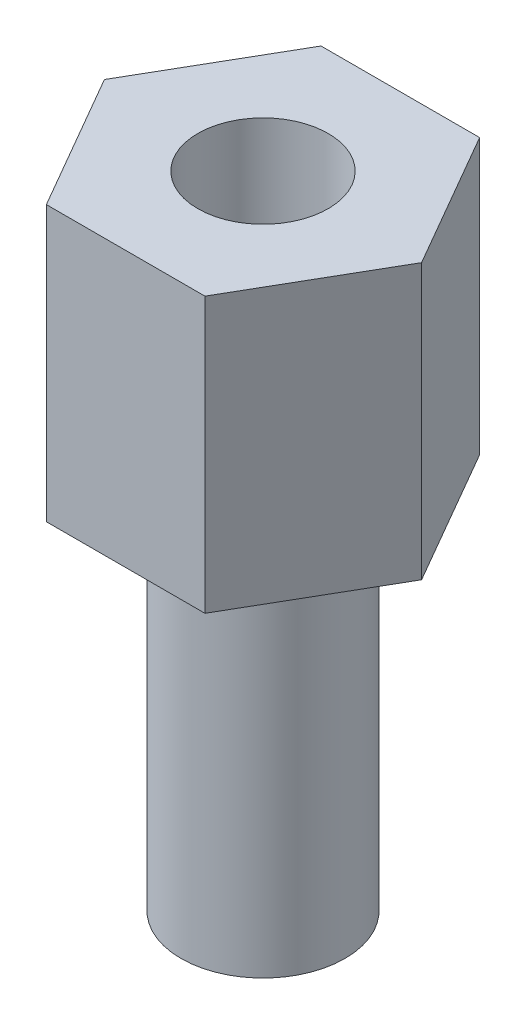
from build123d import *

# Parameters (mm, degrees)
BOSS_EXTRUDE1_DEPTH       = 4.7625
F_4_40_TAPPED_HOLE1_D     = 2.2606
F_4_40_TAPPED_HOLE1_DEPTH = 3.3782
F_4_40_TAPPED_HOLE1_TIP   = 0.679152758
SKETCH4_R                 = 1.4224
BOSS_EXTRUDE2_DEPTH       = 6.35


with BuildPart() as part:
    # Sketch1 → Boss-Extrude1 (new body)
    with BuildSketch(Plane(origin=(0, 0, 0), x_dir=(1, 0, 0), z_dir=(0, 1, 0))):
        Polygon((2.749630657, 0), (1.374815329, 2.38125), (-1.374815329, 2.38125), (-2.749630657, 0), (-1.374815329, -2.38125), (1.374815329, -2.38125), align=None)
    extrude(amount=BOSS_EXTRUDE1_DEPTH)

    # 4-40 Tapped Hole1
    with Locations(Plane(origin=(0, 4.7625, 0), x_dir=(-1, 0, 0), z_dir=(0, 1, 0))):
        with Locations((0, 0)):
            Hole(F_4_40_TAPPED_HOLE1_D / 2, depth=F_4_40_TAPPED_HOLE1_DEPTH)
            with Locations((0, 0, -(F_4_40_TAPPED_HOLE1_DEPTH + F_4_40_TAPPED_HOLE1_TIP / 2))):  # 118° drill point
                Cone(0, F_4_40_TAPPED_HOLE1_D / 2, F_4_40_TAPPED_HOLE1_TIP, mode=Mode.SUBTRACT)

    # Sketch4 → Boss-Extrude2 (add)
    with BuildSketch(Plane.XZ):
        with Locations(Location((0, 0, 0), (0, 0, 90))):
            Circle(SKETCH4_R)
    extrude(amount=BOSS_EXTRUDE2_DEPTH)


solid = part.part
